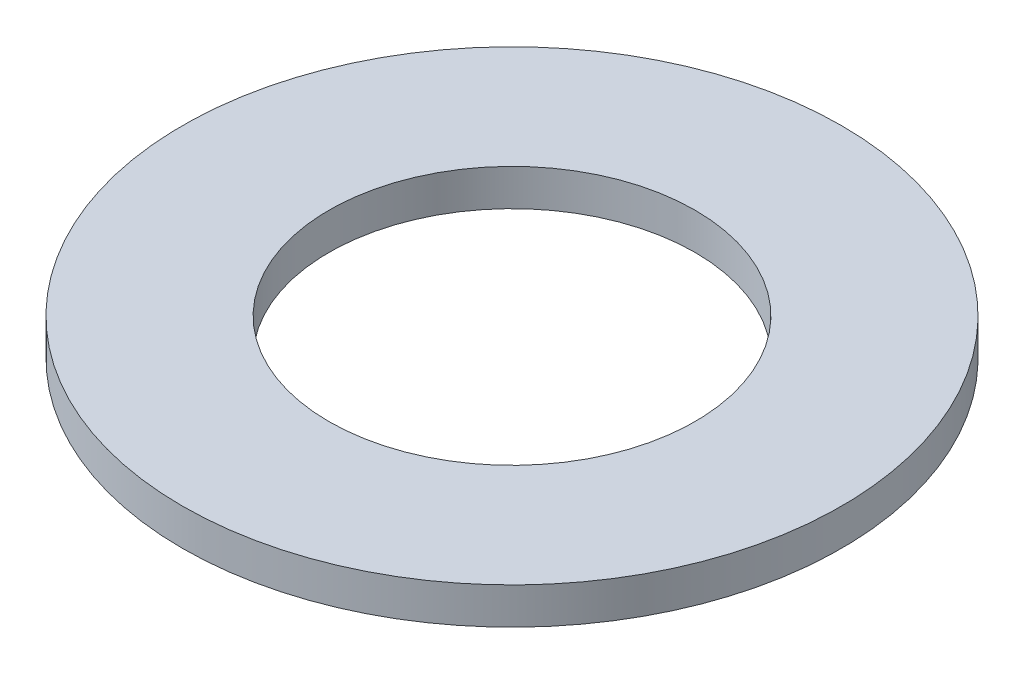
from build123d import *

# Parameters (mm, degrees)
SKETCH1_R           = 9
SKETCH1_R_2         = 5
BOSS_EXTRUDE1_DEPTH = 1


with BuildPart() as part:
    # Sketch1 → Boss-Extrude1 (new body)
    with BuildSketch(Plane(origin=(0, 0, 0), x_dir=(1, 0, 0), z_dir=(0, 1, 0))):
        with Locations(Location((0, 0, 0), (0, 0, 270))):
            Circle(SKETCH1_R)
        with Locations(Location((0, 0, 0), (0, 0, 270))):
            Circle(SKETCH1_R_2, mode=Mode.SUBTRACT)
    extrude(amount=BOSS_EXTRUDE1_DEPTH)


solid = part.part
